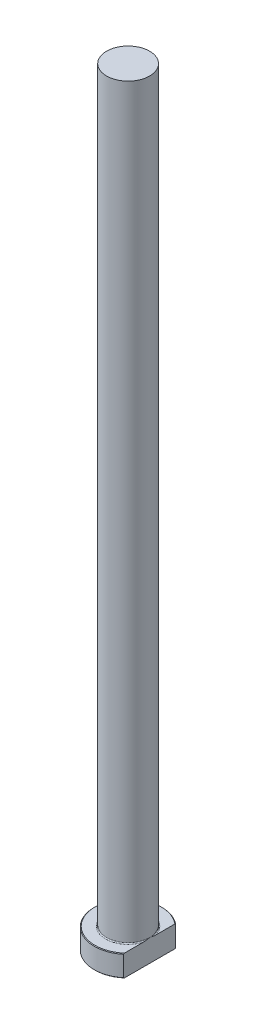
ISO-10303-21;
HEADER;
FILE_DESCRIPTION(('STEP AP214'),'2;1');
FILE_NAME('part.step','',(''),(''),'','','');
FILE_SCHEMA(('AUTOMOTIVE_DESIGN { 1 0 10303 214 1 1 1 1 }'));
ENDSEC;
DATA;
#1=APPLICATION_CONTEXT('core data for automotive mechanical design processes');
#2=APPLICATION_PROTOCOL_DEFINITION('international standard','automotive_design',2000,#1);
#3=PRODUCT_CONTEXT('',#1,'mechanical');
#4=PRODUCT('Part','Part','',(#3));
#5=PRODUCT_RELATED_PRODUCT_CATEGORY('part','',(#4));
#6=PRODUCT_DEFINITION_FORMATION('','',#4);
#7=PRODUCT_DEFINITION_CONTEXT('part definition',#1,'design');
#8=PRODUCT_DEFINITION('design','',#6,#7);
#9=PRODUCT_DEFINITION_SHAPE('','',#8);
#10=(LENGTH_UNIT() NAMED_UNIT(*) SI_UNIT(.MILLI.,.METRE.));
#11=(NAMED_UNIT(*) PLANE_ANGLE_UNIT() SI_UNIT($,.RADIAN.));
#12=(NAMED_UNIT(*) SI_UNIT($,.STERADIAN.) SOLID_ANGLE_UNIT());
#13=UNCERTAINTY_MEASURE_WITH_UNIT(LENGTH_MEASURE(1.E-05),#10,'distance_accuracy_value','');
#14=(GEOMETRIC_REPRESENTATION_CONTEXT(3) GLOBAL_UNCERTAINTY_ASSIGNED_CONTEXT((#13)) GLOBAL_UNIT_ASSIGNED_CONTEXT((#10,
#11,#12)) REPRESENTATION_CONTEXT('',''));
#15=CARTESIAN_POINT('',(0.,0.,0.));
#16=DIRECTION('',(0.,0.,1.));
#17=DIRECTION('',(1.,0.,0.));
#18=AXIS2_PLACEMENT_3D('',#15,#16,#17);
#19=CARTESIAN_POINT('',(0.,0.,0.));
#20=DIRECTION('',(0.,-1.,0.));
#21=DIRECTION('',(0.,0.,-1.));
#22=AXIS2_PLACEMENT_3D('',#19,#20,#21);
#23=PLANE('',#22);
#24=CARTESIAN_POINT('',(0.,0.,0.));
#25=DIRECTION('',(0.,-1.,0.));
#26=DIRECTION('',(0.,0.,-1.));
#27=AXIS2_PLACEMENT_3D('',#24,#25,#26);
#28=CIRCLE('',#27,10.7999999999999);
#29=CARTESIAN_POINT('',(6.99999999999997,0.,8.2243540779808));
#30=VERTEX_POINT('',#29);
#31=CARTESIAN_POINT('',(6.99999999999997,0.,-8.2243540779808));
#32=VERTEX_POINT('',#31);
#33=EDGE_CURVE('E98',#30,#32,#28,.T.);
#34=ORIENTED_EDGE('',*,*,#33,.T.);
#35=DIRECTION('',(0.,0.,1.));
#36=VECTOR('',#35,1.);
#37=CARTESIAN_POINT('',(6.99999999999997,0.,-8.48528137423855));
#38=LINE('',#37,#36);
#39=EDGE_CURVE('E83',#32,#30,#38,.T.);
#40=ORIENTED_EDGE('',*,*,#39,.T.);
#41=EDGE_LOOP('',(#34,#40));
#42=FACE_BOUND('',#41,.T.);
#43=ADVANCED_FACE('F32',(#42),#23,.T.);
#44=CARTESIAN_POINT('',(0.,259.958771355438,0.));
#45=DIRECTION('',(0.,1.,0.));
#46=DIRECTION('',(0.,0.,1.));
#47=AXIS2_PLACEMENT_3D('',#44,#45,#46);
#48=CYLINDRICAL_SURFACE('',#47,11.);
#49=CARTESIAN_POINT('',(0.,6.79999999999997,0.));
#50=DIRECTION('',(0.,1.,0.));
#51=DIRECTION('',(0.,0.,1.));
#52=AXIS2_PLACEMENT_3D('',#49,#50,#51);
#53=CIRCLE('',#52,11.);
#54=CARTESIAN_POINT('',(6.99999999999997,6.79999999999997,8.48528137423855));
#55=VERTEX_POINT('',#54);
#56=CARTESIAN_POINT('',(6.99999999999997,6.79999999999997,-8.48528137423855));
#57=VERTEX_POINT('',#56);
#58=EDGE_CURVE('E104',#55,#57,#53,.F.);
#59=ORIENTED_EDGE('',*,*,#58,.T.);
#60=DIRECTION('',(0.,-1.,0.));
#61=VECTOR('',#60,1.);
#62=CARTESIAN_POINT('',(6.99999999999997,250.,-8.48528137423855));
#63=LINE('',#62,#61);
#64=CARTESIAN_POINT('',(6.99999999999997,0.200000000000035,-8.48528137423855));
#65=VERTEX_POINT('',#64);
#66=EDGE_CURVE('E183',#57,#65,#63,.T.);
#67=ORIENTED_EDGE('',*,*,#66,.T.);
#68=CARTESIAN_POINT('',(0.,0.200000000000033,0.));
#69=DIRECTION('',(0.,-1.,0.));
#70=DIRECTION('',(0.,0.,-1.));
#71=AXIS2_PLACEMENT_3D('',#68,#69,#70);
#72=CIRCLE('',#71,11.);
#73=CARTESIAN_POINT('',(6.99999999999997,0.200000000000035,8.48528137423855));
#74=VERTEX_POINT('',#73);
#75=EDGE_CURVE('E100',#65,#74,#72,.F.);
#76=ORIENTED_EDGE('',*,*,#75,.T.);
#77=DIRECTION('',(0.,-1.,0.));
#78=VECTOR('',#77,1.);
#79=CARTESIAN_POINT('',(6.99999999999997,250.,8.48528137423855));
#80=LINE('',#79,#78);
#81=EDGE_CURVE('E93',#55,#74,#80,.T.);
#82=ORIENTED_EDGE('',*,*,#81,.F.);
#83=EDGE_LOOP('',(#59,#67,#76,#82));
#84=FACE_BOUND('',#83,.T.);
#85=ADVANCED_FACE('F158',(#84),#48,.T.);
#86=CARTESIAN_POINT('',(-11.,7.,0.));
#87=DIRECTION('',(0.,1.,0.));
#88=DIRECTION('',(0.,0.,1.));
#89=AXIS2_PLACEMENT_3D('',#86,#87,#88);
#90=PLANE('',#89);
#91=CARTESIAN_POINT('',(0.,7.,0.));
#92=DIRECTION('',(0.,1.,0.));
#93=DIRECTION('',(0.,0.,1.));
#94=AXIS2_PLACEMENT_3D('',#91,#92,#93);
#95=CIRCLE('',#94,10.8);
#96=CARTESIAN_POINT('',(6.99999999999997,7.,-8.2243540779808));
#97=VERTEX_POINT('',#96);
#98=CARTESIAN_POINT('',(6.99999999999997,7.,8.2243540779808));
#99=VERTEX_POINT('',#98);
#100=EDGE_CURVE('E178',#97,#99,#95,.T.);
#101=ORIENTED_EDGE('',*,*,#100,.T.);
#102=DIRECTION('',(0.,0.,-1.));
#103=VECTOR('',#102,1.);
#104=CARTESIAN_POINT('',(6.99999999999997,7.,0.));
#105=LINE('',#104,#103);
#106=CARTESIAN_POINT('',(6.99999999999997,6.99999999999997,2.07123151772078));
#107=VERTEX_POINT('',#106);
#108=EDGE_CURVE('E57',#99,#107,#105,.T.);
#109=ORIENTED_EDGE('',*,*,#108,.T.);
#110=CARTESIAN_POINT('',(0.,7.,0.));
#111=DIRECTION('',(0.,1.,0.));
#112=DIRECTION('',(0.,0.,1.));
#113=AXIS2_PLACEMENT_3D('',#110,#111,#112);
#114=CIRCLE('',#113,7.29999999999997);
#115=CARTESIAN_POINT('',(6.99999999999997,6.99999999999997,-2.07123151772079));
#116=VERTEX_POINT('',#115);
#117=EDGE_CURVE('E107',#107,#116,#114,.F.);
#118=ORIENTED_EDGE('',*,*,#117,.T.);
#119=EDGE_CURVE('E136',#116,#97,#105,.T.);
#120=ORIENTED_EDGE('',*,*,#119,.T.);
#121=EDGE_LOOP('',(#101,#109,#118,#120));
#122=FACE_BOUND('',#121,.T.);
#123=ADVANCED_FACE('F147',(#122),#90,.T.);
#124=CARTESIAN_POINT('',(0.,7.00000000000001,0.));
#125=DIRECTION('',(0.,-1.,0.));
#126=DIRECTION('',(0.,0.,-1.));
#127=AXIS2_PLACEMENT_3D('',#124,#125,#126);
#128=CONICAL_SURFACE('',#127,10.7999999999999,0.785398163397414);
#129=ORIENTED_EDGE('',*,*,#58,.F.);
#130=CARTESIAN_POINT('',(6.99999999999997,-2.13774979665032,18.6685261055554));
#131=CARTESIAN_POINT('',(6.99999999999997,-1.8657487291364,18.3780244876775));
#132=CARTESIAN_POINT('',(6.99999999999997,-1.59415659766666,18.0871392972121));
#133=CARTESIAN_POINT('',(6.99999999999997,-1.05192877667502,17.5044755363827));
#134=CARTESIAN_POINT('',(6.99999999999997,-0.781293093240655,17.2126969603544));
#135=CARTESIAN_POINT('',(6.99999999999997,-0.241050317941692,16.628048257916));
#136=CARTESIAN_POINT('',(6.99999999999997,0.0285564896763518,16.3351778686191));
#137=CARTESIAN_POINT('',(6.99999999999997,0.566485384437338,15.7482616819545));
#138=CARTESIAN_POINT('',(6.99999999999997,0.834807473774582,15.4542158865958));
#139=CARTESIAN_POINT('',(6.99999999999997,1.64198377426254,14.5651645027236));
#140=CARTESIAN_POINT('',(6.99999999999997,2.17856420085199,13.9680841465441));
#141=CARTESIAN_POINT('',(6.99999999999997,2.97696333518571,13.06681441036));
#142=CARTESIAN_POINT('',(6.99999999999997,3.24199785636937,12.7654727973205));
#143=CARTESIAN_POINT('',(6.99999999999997,3.76945856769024,12.1605141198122));
#144=CARTESIAN_POINT('',(6.99999999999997,4.03188476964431,11.8568970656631));
#145=CARTESIAN_POINT('',(6.99999999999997,4.50733797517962,11.3009625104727));
#146=CARTESIAN_POINT('',(6.99999999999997,4.7208802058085,11.0490858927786));
#147=CARTESIAN_POINT('',(6.99999999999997,5.14538078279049,10.5431655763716));
#148=CARTESIAN_POINT('',(6.99999999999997,5.35633915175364,10.2891218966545));
#149=CARTESIAN_POINT('',(6.99999999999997,5.77522964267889,9.7783673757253));
#150=CARTESIAN_POINT('',(6.99999999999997,5.98316044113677,9.52165544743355));
#151=CARTESIAN_POINT('',(6.99999999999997,6.39521098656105,9.00519084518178));
#152=CARTESIAN_POINT('',(6.99999999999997,6.59933078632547,8.74543821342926));
#153=CARTESIAN_POINT('',(6.99999999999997,7.00243445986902,8.22283607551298));
#154=CARTESIAN_POINT('',(6.99999999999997,7.20142819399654,7.95999419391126));
#155=CARTESIAN_POINT('',(6.99999999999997,7.59353840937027,7.42991856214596));
#156=CARTESIAN_POINT('',(6.99999999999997,7.78665447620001,7.16268450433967));
#157=CARTESIAN_POINT('',(6.99999999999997,8.16523718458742,6.62311113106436));
#158=CARTESIAN_POINT('',(6.99999999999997,8.35070911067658,6.35077553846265));
#159=CARTESIAN_POINT('',(6.99999999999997,8.71189725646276,5.7997373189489));
#160=CARTESIAN_POINT('',(6.99999999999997,8.88761537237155,5.5210359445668));
#161=CARTESIAN_POINT('',(6.99999999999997,9.19554959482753,5.00707921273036));
#162=CARTESIAN_POINT('',(6.99999999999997,9.3298807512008,4.77309669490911));
#163=CARTESIAN_POINT('',(6.99999999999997,9.58764253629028,4.29911523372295));
#164=CARTESIAN_POINT('',(6.99999999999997,9.71107181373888,4.05911554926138));
#165=CARTESIAN_POINT('',(6.99999999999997,9.94390907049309,3.57263619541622));
#166=CARTESIAN_POINT('',(6.99999999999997,10.0533307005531,3.3261631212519));
#167=CARTESIAN_POINT('',(6.99999999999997,10.2545146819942,2.82607166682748));
#168=CARTESIAN_POINT('',(6.99999999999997,10.3462820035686,2.57245532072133));
#169=CARTESIAN_POINT('',(6.99999999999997,10.4907049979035,2.11254447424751));
#170=CARTESIAN_POINT('',(6.99999999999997,10.5475277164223,1.90756611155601));
#171=CARTESIAN_POINT('',(6.99999999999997,10.6452043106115,1.49381161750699));
#172=CARTESIAN_POINT('',(6.99999999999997,10.68606033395,1.2850360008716));
#173=CARTESIAN_POINT('',(6.99999999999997,10.749755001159,0.865342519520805));
#174=CARTESIAN_POINT('',(6.99999999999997,10.772646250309,0.654432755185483));
#175=CARTESIAN_POINT('',(6.99999999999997,10.7993569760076,0.231396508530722));
#176=CARTESIAN_POINT('',(6.99999999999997,10.8031771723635,0.0192700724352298));
#177=CARTESIAN_POINT('',(6.99999999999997,10.7915178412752,-0.404715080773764));
#178=CARTESIAN_POINT('',(6.99999999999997,10.7760135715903,-0.616573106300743));
#179=CARTESIAN_POINT('',(6.99999999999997,10.7265413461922,-1.03810446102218));
#180=CARTESIAN_POINT('',(6.99999999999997,10.6925718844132,-1.24777761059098));
#181=CARTESIAN_POINT('',(6.99999999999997,10.6077703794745,-1.66430273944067));
#182=CARTESIAN_POINT('',(6.99999999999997,10.5568873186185,-1.87114418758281));
#183=CARTESIAN_POINT('',(6.99999999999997,10.4404729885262,-2.28061279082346));
#184=CARTESIAN_POINT('',(6.99999999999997,10.3749414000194,-2.48323985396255));
#185=CARTESIAN_POINT('',(6.99999999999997,10.2190980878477,-2.91860265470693));
#186=CARTESIAN_POINT('',(6.99999999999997,10.1264616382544,-3.15050038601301));
#187=CARTESIAN_POINT('',(6.99999999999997,9.92740958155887,-3.60835455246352));
#188=CARTESIAN_POINT('',(6.99999999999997,9.8209876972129,-3.83430822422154));
#189=CARTESIAN_POINT('',(6.99999999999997,9.59695142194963,-4.28105341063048));
#190=CARTESIAN_POINT('',(6.99999999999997,9.47931762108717,-4.50183511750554));
#191=CARTESIAN_POINT('',(6.99999999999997,9.23524231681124,-4.93840249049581));
#192=CARTESIAN_POINT('',(6.99999999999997,9.10880204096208,-5.1541888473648));
#193=CARTESIAN_POINT('',(6.99999999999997,8.84714657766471,-5.58417945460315));
#194=CARTESIAN_POINT('',(6.99999999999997,8.71183920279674,-5.79832734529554));
#195=CARTESIAN_POINT('',(6.99999999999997,8.43533082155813,-6.22277635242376));
#196=CARTESIAN_POINT('',(6.99999999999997,8.29412966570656,-6.43307737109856));
#197=CARTESIAN_POINT('',(6.99999999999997,8.00706556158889,-6.85014007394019));
#198=CARTESIAN_POINT('',(6.99999999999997,7.86120763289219,-7.05690522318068));
#199=CARTESIAN_POINT('',(6.99999999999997,7.56553131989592,-7.46757278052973));
#200=CARTESIAN_POINT('',(6.99999999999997,7.41571298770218,-7.67147522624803));
#201=CARTESIAN_POINT('',(6.99999999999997,7.0799970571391,-8.12067189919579));
#202=CARTESIAN_POINT('',(6.99999999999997,6.89330819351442,-8.36537403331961));
#203=CARTESIAN_POINT('',(6.99999999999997,6.51597189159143,-8.85171196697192));
#204=CARTESIAN_POINT('',(6.99999999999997,6.32532432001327,-9.09334766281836));
#205=CARTESIAN_POINT('',(6.99999999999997,5.94076020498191,-9.57404667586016));
#206=CARTESIAN_POINT('',(6.99999999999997,5.74684327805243,-9.81310968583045));
#207=CARTESIAN_POINT('',(6.99999999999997,5.35630729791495,-10.2890203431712));
#208=CARTESIAN_POINT('',(6.99999999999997,5.15968820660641,-10.5258679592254));
#209=CARTESIAN_POINT('',(6.99999999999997,4.5660695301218,-11.2340330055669));
#210=CARTESIAN_POINT('',(6.99999999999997,4.16568148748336,-11.7025100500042));
#211=CARTESIAN_POINT('',(6.99999999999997,3.3584003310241,-12.6338245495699));
#212=CARTESIAN_POINT('',(6.99999999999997,2.95150704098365,-13.0966618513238));
#213=CARTESIAN_POINT('',(6.99999999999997,2.35017562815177,-13.7734103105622));
#214=CARTESIAN_POINT('',(6.99999999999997,2.15763812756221,-13.9890143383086));
#215=CARTESIAN_POINT('',(6.99999999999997,1.77161609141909,-14.4193671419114));
#216=CARTESIAN_POINT('',(6.99999999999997,1.57813157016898,-14.6341159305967));
#217=CARTESIAN_POINT('',(6.99999999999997,0.99641244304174,-15.277238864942));
#218=CARTESIAN_POINT('',(6.99999999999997,0.60692265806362,-15.704477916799));
#219=CARTESIAN_POINT('',(6.99999999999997,-0.173895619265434,-16.5556520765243));
#220=CARTESIAN_POINT('',(6.99999999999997,-0.565218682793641,-16.9795921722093));
#221=CARTESIAN_POINT('',(6.99999999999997,-1.34999931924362,-17.8254589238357));
#222=CARTESIAN_POINT('',(6.99999999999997,-1.74345679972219,-18.2473856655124));
#223=CARTESIAN_POINT('',(6.99999999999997,-2.13774979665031,-18.6685261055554));
#224=B_SPLINE_CURVE_WITH_KNOTS('',3,(#130,#131,#132,#133,#134,#135,#136,#137,#138,#139,#140,
#141,#142,#143,#144,#145,#146,#147,#148,#149,#150,#151,#152,#153,#154,#155,#156,#157,#158,#159,
#160,#161,#162,#163,#164,#165,#166,#167,#168,#169,#170,#171,#172,#173,#174,#175,#176,#177,#178,
#179,#180,#181,#182,#183,#184,#185,#186,#187,#188,#189,#190,#191,#192,#193,#194,#195,#196,#197,
#198,#199,#200,#201,#202,#203,#204,#205,#206,#207,#208,#209,#210,#211,#212,#213,#214,#215,#216,
#217,#218,#219,#220,#221,#222,#223),.UNSPECIFIED.,.F.,.F.,(4,2,2,2,2,2,2,2,2,2,2,2,2,2,2,2,2,2,
2,2,2,2,2,2,2,2,2,2,2,2,2,2,2,2,2,2,2,2,2,2,2,2,2,2,2,2,4),(0.,1.19389386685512,
2.38779531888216,3.58200567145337,4.77621398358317,7.18442154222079,8.38834194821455,
9.5922568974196,10.5828886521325,11.5735117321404,12.5645555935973,13.5555857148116,
14.5445404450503,15.5335647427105,16.5218934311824,17.5100293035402,18.3192088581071,
19.1284885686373,19.93697351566,20.7452305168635,21.3828127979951,22.0203092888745,
22.6559319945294,23.2915307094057,23.9279440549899,24.5644093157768,25.2028120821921,
25.8412287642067,26.589809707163,27.3387327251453,28.0889766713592,28.8391162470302,
29.5989369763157,30.3587769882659,31.1178239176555,31.876860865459,32.800165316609,
33.7235009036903,34.6469455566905,35.5704032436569,37.4191008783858,39.267848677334,
40.1350269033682,41.0021920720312,42.7365692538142,44.4673795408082,46.1981154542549),.UNSPECIFIED.);
#225=EDGE_CURVE('E135',#55,#99,#224,.T.);
#226=ORIENTED_EDGE('',*,*,#225,.T.);
#227=ORIENTED_EDGE('',*,*,#100,.F.);
#228=EDGE_CURVE('E127',#97,#57,#224,.T.);
#229=ORIENTED_EDGE('',*,*,#228,.T.);
#230=EDGE_LOOP('',(#129,#226,#227,#229));
#231=FACE_BOUND('',#230,.T.);
#232=ADVANCED_FACE('F143',(#231),#128,.T.);
#233=CARTESIAN_POINT('',(0.,0.200000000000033,0.));
#234=DIRECTION('',(0.,1.,0.));
#235=DIRECTION('',(0.,0.,1.));
#236=AXIS2_PLACEMENT_3D('',#233,#234,#235);
#237=CONICAL_SURFACE('',#236,11.,0.785398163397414);
#238=ORIENTED_EDGE('',*,*,#75,.F.);
#239=CARTESIAN_POINT('',(6.99999999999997,9.13774979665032,-18.6685261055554));
#240=CARTESIAN_POINT('',(6.99999999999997,8.86574872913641,-18.3780244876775));
#241=CARTESIAN_POINT('',(6.99999999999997,8.59415659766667,-18.0871392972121));
#242=CARTESIAN_POINT('',(6.99999999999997,8.05192877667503,-17.5044755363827));
#243=CARTESIAN_POINT('',(6.99999999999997,7.78129309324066,-17.2126969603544));
#244=CARTESIAN_POINT('',(6.99999999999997,7.2410503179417,-16.628048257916));
#245=CARTESIAN_POINT('',(6.99999999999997,6.97144351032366,-16.3351778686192));
#246=CARTESIAN_POINT('',(6.99999999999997,6.43351461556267,-15.7482616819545));
#247=CARTESIAN_POINT('',(6.99999999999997,6.16519252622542,-15.4542158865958));
#248=CARTESIAN_POINT('',(6.99999999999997,5.35801622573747,-14.5651645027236));
#249=CARTESIAN_POINT('',(6.99999999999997,4.82143579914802,-13.9680841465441));
#250=CARTESIAN_POINT('',(6.99999999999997,4.0230366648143,-13.06681441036));
#251=CARTESIAN_POINT('',(6.99999999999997,3.75800214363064,-12.7654727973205));
#252=CARTESIAN_POINT('',(6.99999999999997,3.23054143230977,-12.1605141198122));
#253=CARTESIAN_POINT('',(6.99999999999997,2.96811523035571,-11.8568970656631));
#254=CARTESIAN_POINT('',(6.99999999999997,2.49266202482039,-11.3009625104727));
#255=CARTESIAN_POINT('',(6.99999999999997,2.27911979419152,-11.0490858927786));
#256=CARTESIAN_POINT('',(6.99999999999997,1.85461921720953,-10.5431655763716));
#257=CARTESIAN_POINT('',(6.99999999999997,1.64366084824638,-10.2891218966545));
#258=CARTESIAN_POINT('',(6.99999999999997,1.22477035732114,-9.77836737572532));
#259=CARTESIAN_POINT('',(6.99999999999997,1.01683955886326,-9.52165544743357));
#260=CARTESIAN_POINT('',(6.99999999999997,0.60478901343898,-9.00519084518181));
#261=CARTESIAN_POINT('',(6.99999999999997,0.400669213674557,-8.74543821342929));
#262=CARTESIAN_POINT('',(6.99999999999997,-0.00243445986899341,-8.22283607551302));
#263=CARTESIAN_POINT('',(6.99999999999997,-0.201428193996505,-7.9599941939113));
#264=CARTESIAN_POINT('',(6.99999999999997,-0.593538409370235,-7.429918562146));
#265=CARTESIAN_POINT('',(6.99999999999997,-0.786654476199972,-7.16268450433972));
#266=CARTESIAN_POINT('',(6.99999999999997,-1.16523718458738,-6.62311113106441));
#267=CARTESIAN_POINT('',(6.99999999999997,-1.35070911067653,-6.35077553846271));
#268=CARTESIAN_POINT('',(6.99999999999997,-1.71189725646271,-5.79973731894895));
#269=CARTESIAN_POINT('',(6.99999999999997,-1.8876153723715,-5.52103594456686));
#270=CARTESIAN_POINT('',(6.99999999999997,-2.19554959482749,-5.00707921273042));
#271=CARTESIAN_POINT('',(6.99999999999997,-2.32988075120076,-4.77309669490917));
#272=CARTESIAN_POINT('',(6.99999999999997,-2.58764253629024,-4.29911523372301));
#273=CARTESIAN_POINT('',(6.99999999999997,-2.71107181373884,-4.05911554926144));
#274=CARTESIAN_POINT('',(6.99999999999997,-2.94390907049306,-3.57263619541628));
#275=CARTESIAN_POINT('',(6.99999999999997,-3.05333070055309,-3.32616312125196));
#276=CARTESIAN_POINT('',(6.99999999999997,-3.25451468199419,-2.82607166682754));
#277=CARTESIAN_POINT('',(6.99999999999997,-3.34628200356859,-2.57245532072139));
#278=CARTESIAN_POINT('',(6.99999999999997,-3.49070499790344,-2.11254447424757));
#279=CARTESIAN_POINT('',(6.99999999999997,-3.54752771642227,-1.90756611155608));
#280=CARTESIAN_POINT('',(6.99999999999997,-3.6452043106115,-1.49381161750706));
#281=CARTESIAN_POINT('',(6.99999999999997,-3.68606033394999,-1.28503600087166));
#282=CARTESIAN_POINT('',(6.99999999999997,-3.74975500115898,-0.865342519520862));
#283=CARTESIAN_POINT('',(6.99999999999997,-3.77264625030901,-0.65443275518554));
#284=CARTESIAN_POINT('',(6.99999999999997,-3.79935697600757,-0.231396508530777));
#285=CARTESIAN_POINT('',(6.99999999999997,-3.80317717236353,-0.0192700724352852));
#286=CARTESIAN_POINT('',(6.99999999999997,-3.79151784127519,0.404715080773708));
#287=CARTESIAN_POINT('',(6.99999999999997,-3.77601357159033,0.616573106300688));
#288=CARTESIAN_POINT('',(6.99999999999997,-3.7265413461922,1.03810446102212));
#289=CARTESIAN_POINT('',(6.99999999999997,-3.69257188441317,1.24777761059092));
#290=CARTESIAN_POINT('',(6.99999999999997,-3.60777037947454,1.66430273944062));
#291=CARTESIAN_POINT('',(6.99999999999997,-3.55688731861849,1.87114418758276));
#292=CARTESIAN_POINT('',(6.99999999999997,-3.44047298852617,2.28061279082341));
#293=CARTESIAN_POINT('',(6.99999999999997,-3.37494140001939,2.48323985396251));
#294=CARTESIAN_POINT('',(6.99999999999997,-3.21909808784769,2.91860265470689));
#295=CARTESIAN_POINT('',(6.99999999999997,-3.12646163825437,3.15050038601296));
#296=CARTESIAN_POINT('',(6.99999999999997,-2.92740958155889,3.60835455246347));
#297=CARTESIAN_POINT('',(6.99999999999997,-2.82098769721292,3.83430822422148));
#298=CARTESIAN_POINT('',(6.99999999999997,-2.59695142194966,4.28105341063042));
#299=CARTESIAN_POINT('',(6.99999999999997,-2.4793176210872,4.50183511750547));
#300=CARTESIAN_POINT('',(6.99999999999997,-2.23524231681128,4.93840249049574));
#301=CARTESIAN_POINT('',(6.99999999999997,-2.10880204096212,5.15418884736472));
#302=CARTESIAN_POINT('',(6.99999999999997,-1.84714657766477,5.58417945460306));
#303=CARTESIAN_POINT('',(6.99999999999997,-1.7118392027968,5.79832734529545));
#304=CARTESIAN_POINT('',(6.99999999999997,-1.43533082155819,6.22277635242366));
#305=CARTESIAN_POINT('',(6.99999999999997,-1.29412966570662,6.43307737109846));
#306=CARTESIAN_POINT('',(6.99999999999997,-1.00706556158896,6.85014007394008));
#307=CARTESIAN_POINT('',(6.99999999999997,-0.86120763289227,7.05690522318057));
#308=CARTESIAN_POINT('',(6.99999999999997,-0.565531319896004,7.46757278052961));
#309=CARTESIAN_POINT('',(6.99999999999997,-0.415712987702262,7.6714752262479));
#310=CARTESIAN_POINT('',(6.99999999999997,-0.0799970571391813,8.12067189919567));
#311=CARTESIAN_POINT('',(6.99999999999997,0.1066918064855,8.36537403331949));
#312=CARTESIAN_POINT('',(6.99999999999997,0.484028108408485,8.85171196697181));
#313=CARTESIAN_POINT('',(6.99999999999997,0.674675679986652,9.09334766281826));
#314=CARTESIAN_POINT('',(6.99999999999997,1.05923979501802,9.57404667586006));
#315=CARTESIAN_POINT('',(6.99999999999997,1.2531567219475,9.81310968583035));
#316=CARTESIAN_POINT('',(6.99999999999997,1.64369270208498,10.2890203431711));
#317=CARTESIAN_POINT('',(6.99999999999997,1.84031179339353,10.5258679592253));
#318=CARTESIAN_POINT('',(6.99999999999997,2.43393046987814,11.2340330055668));
#319=CARTESIAN_POINT('',(6.99999999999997,2.83431851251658,11.7025100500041));
#320=CARTESIAN_POINT('',(6.99999999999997,3.64159966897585,12.6338245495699));
#321=CARTESIAN_POINT('',(6.99999999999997,4.04849295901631,13.0966618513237));
#322=CARTESIAN_POINT('',(6.99999999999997,4.64982437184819,13.7734103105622));
#323=CARTESIAN_POINT('',(6.99999999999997,4.84236187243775,13.9890143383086));
#324=CARTESIAN_POINT('',(6.99999999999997,5.22838390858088,14.4193671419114));
#325=CARTESIAN_POINT('',(6.99999999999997,5.42186842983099,14.6341159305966));
#326=CARTESIAN_POINT('',(6.99999999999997,6.00358755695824,15.2772388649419));
#327=CARTESIAN_POINT('',(6.99999999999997,6.39307734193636,15.704477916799));
#328=CARTESIAN_POINT('',(6.99999999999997,7.17389561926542,16.5556520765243));
#329=CARTESIAN_POINT('',(6.99999999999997,7.56521868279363,16.9795921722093));
#330=CARTESIAN_POINT('',(6.99999999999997,8.34999931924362,17.8254589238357));
#331=CARTESIAN_POINT('',(6.99999999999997,8.74345679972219,18.2473856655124));
#332=CARTESIAN_POINT('',(6.99999999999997,9.13774979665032,18.6685261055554));
#333=B_SPLINE_CURVE_WITH_KNOTS('',3,(#239,#240,#241,#242,#243,#244,#245,#246,#247,#248,#249,
#250,#251,#252,#253,#254,#255,#256,#257,#258,#259,#260,#261,#262,#263,#264,#265,#266,#267,#268,
#269,#270,#271,#272,#273,#274,#275,#276,#277,#278,#279,#280,#281,#282,#283,#284,#285,#286,#287,
#288,#289,#290,#291,#292,#293,#294,#295,#296,#297,#298,#299,#300,#301,#302,#303,#304,#305,#306,
#307,#308,#309,#310,#311,#312,#313,#314,#315,#316,#317,#318,#319,#320,#321,#322,#323,#324,#325,
#326,#327,#328,#329,#330,#331,#332),.UNSPECIFIED.,.F.,.F.,(4,2,2,2,2,2,2,2,2,2,2,2,2,2,2,2,2,2,
2,2,2,2,2,2,2,2,2,2,2,2,2,2,2,2,2,2,2,2,2,2,2,2,2,2,2,2,4),(0.,1.19389386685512,
2.38779531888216,3.58200567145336,4.77621398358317,7.18442154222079,8.38834194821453,
9.59225689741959,10.5828886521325,11.5735117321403,12.5645555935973,13.5555857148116,
14.5445404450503,15.5335647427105,16.5218934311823,17.5100293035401,18.319208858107,
19.1284885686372,19.93697351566,20.7452305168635,21.382812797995,22.0203092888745,
22.6559319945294,23.2915307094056,23.9279440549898,24.5644093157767,25.2028120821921,
25.8412287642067,26.589809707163,27.3387327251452,28.0889766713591,28.8391162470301,
29.5989369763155,30.3587769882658,31.1178239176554,31.8768608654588,32.8001653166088,
33.7235009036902,34.6469455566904,35.5704032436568,37.4191008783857,39.2678486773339,
40.1350269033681,41.0021920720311,42.7365692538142,44.4673795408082,46.1981154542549),.UNSPECIFIED.);
#334=EDGE_CURVE('E86',#65,#32,#333,.T.);
#335=ORIENTED_EDGE('',*,*,#334,.T.);
#336=ORIENTED_EDGE('',*,*,#33,.F.);
#337=EDGE_CURVE('E89',#30,#74,#333,.T.);
#338=ORIENTED_EDGE('',*,*,#337,.T.);
#339=EDGE_LOOP('',(#238,#335,#336,#338));
#340=FACE_BOUND('',#339,.T.);
#341=ADVANCED_FACE('F97',(#340),#237,.T.);
#342=CARTESIAN_POINT('',(0.,7.29999999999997,0.));
#343=DIRECTION('',(0.,1.,0.));
#344=DIRECTION('',(0.,0.,1.));
#345=AXIS2_PLACEMENT_3D('',#342,#343,#344);
#346=TOROIDAL_SURFACE('',#345,7.29999999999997,0.3);
#347=CARTESIAN_POINT('',(6.99999999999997,7.29999999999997,0.));
#348=CARTESIAN_POINT('',(6.99999999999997,7.30000062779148,2.32628005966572E-11));
#349=CARTESIAN_POINT('',(6.99999999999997,7.30000125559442,-3.16909134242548E-07));
#350=CARTESIAN_POINT('',(6.99999999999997,7.30000241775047,-1.14637029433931E-06));
#351=CARTESIAN_POINT('',(6.99999999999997,7.30000292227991,-1.68168827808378E-06));
#352=CARTESIAN_POINT('',(6.99999999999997,7.30000400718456,-2.97869768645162E-06));
#353=CARTESIAN_POINT('',(6.99999999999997,7.30000456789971,-3.76131367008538E-06));
#354=CARTESIAN_POINT('',(6.99999999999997,7.30000553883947,-5.35167977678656E-06));
#355=CARTESIAN_POINT('',(6.99999999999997,7.30000595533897,-6.15604635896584E-06));
#356=CARTESIAN_POINT('',(6.99999999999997,7.30000758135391,-9.388029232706E-06));
#357=CARTESIAN_POINT('',(6.99999999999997,7.30000871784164,-1.18573464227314E-05));
#358=CARTESIAN_POINT('',(6.99999999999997,7.30001050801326,-1.66549715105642E-05));
#359=CARTESIAN_POINT('',(6.99999999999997,7.30001120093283,-1.89691200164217E-05));
#360=CARTESIAN_POINT('',(6.99999999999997,7.30001423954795,-2.9073526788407E-05));
#361=CARTESIAN_POINT('',(6.99999999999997,7.30001661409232,-3.68567169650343E-05));
#362=CARTESIAN_POINT('',(6.99999999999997,7.30001997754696,-5.13387672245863E-05));
#363=CARTESIAN_POINT('',(6.99999999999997,7.30002113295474,-5.79981986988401E-05));
#364=CARTESIAN_POINT('',(6.99999999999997,7.30002974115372,-0.000108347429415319));
#365=CARTESIAN_POINT('',(6.99999999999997,7.30003649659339,-0.000152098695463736));
#366=CARTESIAN_POINT('',(6.99999999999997,7.30006604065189,-0.000326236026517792));
#367=CARTESIAN_POINT('',(6.99999999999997,7.30009398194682,-0.000455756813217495));
#368=CARTESIAN_POINT('',(6.99999999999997,7.30020370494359,-0.000971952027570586));
#369=CARTESIAN_POINT('',(6.99999999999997,7.30028233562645,-0.00135905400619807));
#370=CARTESIAN_POINT('',(6.99999999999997,7.30059908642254,-0.00290811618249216));
#371=CARTESIAN_POINT('',(6.99999999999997,7.30084128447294,-0.00406949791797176));
#372=CARTESIAN_POINT('',(6.99999999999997,7.30185637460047,-0.00894870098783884));
#373=CARTESIAN_POINT('',(6.99999999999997,7.30262406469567,-0.0126672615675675));
#374=CARTESIAN_POINT('',(6.99999999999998,7.30904362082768,-0.0437472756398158));
#375=CARTESIAN_POINT('',(6.99999999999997,7.31471492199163,-0.0711060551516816));
#376=CARTESIAN_POINT('',(6.99999999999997,7.3257989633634,-0.124711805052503));
#377=CARTESIAN_POINT('',(6.99999999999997,7.33121280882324,-0.150958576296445));
#378=CARTESIAN_POINT('',(6.99999999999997,7.34888721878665,-0.236855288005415));
#379=CARTESIAN_POINT('',(6.99999999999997,7.36109504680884,-0.296516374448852));
#380=CARTESIAN_POINT('',(6.99999999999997,7.38163193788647,-0.398125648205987));
#381=CARTESIAN_POINT('',(6.99999999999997,7.39003371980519,-0.440059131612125));
#382=CARTESIAN_POINT('',(6.99999999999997,7.40641913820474,-0.522820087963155));
#383=CARTESIAN_POINT('',(6.99999999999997,7.41440792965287,-0.563646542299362));
#384=CARTESIAN_POINT('',(6.99999999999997,7.44025584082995,-0.697745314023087));
#385=CARTESIAN_POINT('',(6.99999999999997,7.45763052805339,-0.791112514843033));
#386=CARTESIAN_POINT('',(6.99999999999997,7.4907040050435,-0.979068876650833));
#387=CARTESIAN_POINT('',(6.99999999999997,7.50638514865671,-1.07366117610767));
#388=CARTESIAN_POINT('',(6.99999999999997,7.53649600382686,-1.27237182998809));
#389=CARTESIAN_POINT('',(6.99999999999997,7.55066037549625,-1.37653153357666));
#390=CARTESIAN_POINT('',(6.99999999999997,7.57450660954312,-1.58508707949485));
#391=CARTESIAN_POINT('',(6.99999999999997,7.58420070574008,-1.68948148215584));
#392=CARTESIAN_POINT('',(6.99999999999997,7.5971656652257,-1.89515538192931));
#393=CARTESIAN_POINT('',(6.99999999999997,7.60064432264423,-1.9964196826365));
#394=CARTESIAN_POINT('',(6.99999999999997,7.59954163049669,-2.14745317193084));
#395=CARTESIAN_POINT('',(6.99999999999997,7.59815772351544,-2.19724153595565));
#396=CARTESIAN_POINT('',(6.99999999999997,7.59283451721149,-2.29666246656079));
#397=CARTESIAN_POINT('',(6.99999999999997,7.58889656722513,-2.34629510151));
#398=CARTESIAN_POINT('',(6.99999999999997,7.57769755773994,-2.44571674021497));
#399=CARTESIAN_POINT('',(6.99999999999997,7.57040396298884,-2.49550242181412));
#400=CARTESIAN_POINT('',(6.99999999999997,7.5560244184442,-2.56951537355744));
#401=CARTESIAN_POINT('',(6.99999999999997,7.55065780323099,-2.59407625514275));
#402=CARTESIAN_POINT('',(6.99999999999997,7.53852479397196,-2.642845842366));
#403=CARTESIAN_POINT('',(6.99999999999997,7.53175908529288,-2.66705471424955));
#404=CARTESIAN_POINT('',(6.99999999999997,7.5174892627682,-2.71174649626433));
#405=CARTESIAN_POINT('',(6.99999999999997,7.510201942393,-2.73229789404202));
#406=CARTESIAN_POINT('',(6.99999999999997,7.4939308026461,-2.77282387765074));
#407=CARTESIAN_POINT('',(6.99999999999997,7.4849410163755,-2.79279614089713));
#408=CARTESIAN_POINT('',(6.99999999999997,7.46462265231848,-2.83190553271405));
#409=CARTESIAN_POINT('',(6.99999999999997,7.45326134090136,-2.85102586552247));
#410=CARTESIAN_POINT('',(6.99999999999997,7.4274542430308,-2.88704231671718));
#411=CARTESIAN_POINT('',(6.99999999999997,7.41303489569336,-2.90395561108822));
#412=CARTESIAN_POINT('',(6.99999999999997,7.39049681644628,-2.92384155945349));
#413=CARTESIAN_POINT('',(6.99999999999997,7.3841904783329,-2.92884725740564));
#414=CARTESIAN_POINT('',(6.99999999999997,7.3709718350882,-2.9380049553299));
#415=CARTESIAN_POINT('',(6.99999999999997,7.36405938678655,-2.94215675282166));
#416=CARTESIAN_POINT('',(6.99999999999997,7.34956926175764,-2.94936604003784));
#417=CARTESIAN_POINT('',(6.99999999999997,7.34198467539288,-2.95240998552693));
#418=CARTESIAN_POINT('',(6.99999999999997,7.32637763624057,-2.95700924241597));
#419=CARTESIAN_POINT('',(6.99999999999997,7.31835605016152,-2.95856739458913));
#420=CARTESIAN_POINT('',(6.99999999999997,7.3029104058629,-2.95992508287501));
#421=CARTESIAN_POINT('',(6.99999999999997,7.29549953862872,-2.95987367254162));
#422=CARTESIAN_POINT('',(6.99999999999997,7.28081803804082,-2.95838504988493));
#423=CARTESIAN_POINT('',(6.99999999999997,7.27354749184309,-2.95694700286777));
#424=CARTESIAN_POINT('',(6.99999999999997,7.25853285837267,-2.95260391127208));
#425=CARTESIAN_POINT('',(6.99999999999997,7.25083383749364,-2.94954604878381));
#426=CARTESIAN_POINT('',(6.99999999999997,7.23603628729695,-2.9422241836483));
#427=CARTESIAN_POINT('',(6.99999999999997,7.22893877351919,-2.93795819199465));
#428=CARTESIAN_POINT('',(6.99999999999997,7.21163875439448,-2.92593351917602));
#429=CARTESIAN_POINT('',(6.99999999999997,7.20187862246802,-2.91754511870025));
#430=CARTESIAN_POINT('',(6.99999999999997,7.18370674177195,-2.89942475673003));
#431=CARTESIAN_POINT('',(6.99999999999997,7.17529892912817,-2.88968902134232));
#432=CARTESIAN_POINT('',(6.99999999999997,7.15199560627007,-2.85953893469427));
#433=CARTESIAN_POINT('',(6.99999999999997,7.13869481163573,-2.83790736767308));
#434=CARTESIAN_POINT('',(6.99999999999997,7.11507068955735,-2.79314645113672));
#435=CARTESIAN_POINT('',(6.99999999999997,7.10475206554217,-2.77001480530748));
#436=CARTESIAN_POINT('',(6.99999999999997,7.08155610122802,-2.7108784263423));
#437=CARTESIAN_POINT('',(6.99999999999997,7.07006528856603,-2.67433519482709));
#438=CARTESIAN_POINT('',(6.99999999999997,7.05044959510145,-2.60033159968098));
#439=CARTESIAN_POINT('',(6.99999999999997,7.04233234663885,-2.5628693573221));
#440=CARTESIAN_POINT('',(6.99999999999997,7.02853576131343,-2.48688638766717));
#441=CARTESIAN_POINT('',(6.99999999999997,7.02289758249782,-2.4483583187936));
#442=CARTESIAN_POINT('',(6.99999999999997,7.01369461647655,-2.37112071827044));
#443=CARTESIAN_POINT('',(6.99999999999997,7.01012698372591,-2.33241150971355));
#444=CARTESIAN_POINT('',(6.99999999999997,7.00239886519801,-2.22280038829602));
#445=CARTESIAN_POINT('',(6.99999999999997,7.00019016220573,-2.15176184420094));
#446=CARTESIAN_POINT('',(6.99999999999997,6.99983406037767,-2.0096618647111));
#447=CARTESIAN_POINT('',(6.99999999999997,7.00168936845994,-1.9386004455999));
#448=CARTESIAN_POINT('',(6.99999999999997,7.00854815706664,-1.79630907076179));
#449=CARTESIAN_POINT('',(6.99999999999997,7.01356610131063,-1.7250798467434));
#450=CARTESIAN_POINT('',(6.99999999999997,7.02608998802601,-1.5828366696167));
#451=CARTESIAN_POINT('',(6.99999999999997,7.03359634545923,-1.51182275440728));
#452=CARTESIAN_POINT('',(6.99999999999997,7.0575822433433,-1.31152735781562));
#453=CARTESIAN_POINT('',(6.99999999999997,7.07635481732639,-1.18252326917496));
#454=CARTESIAN_POINT('',(6.99999999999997,7.11790553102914,-0.926646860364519));
#455=CARTESIAN_POINT('',(6.99999999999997,7.14063741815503,-0.799766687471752));
#456=CARTESIAN_POINT('',(6.99999999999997,7.17322033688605,-0.627620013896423));
#457=CARTESIAN_POINT('',(6.99999999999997,7.18199317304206,-0.582145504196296));
#458=CARTESIAN_POINT('',(6.99999999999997,7.20004716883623,-0.489938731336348));
#459=CARTESIAN_POINT('',(6.99999999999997,7.20933569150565,-0.443207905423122));
#460=CARTESIAN_POINT('',(6.99999999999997,7.22546843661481,-0.362914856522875));
#461=CARTESIAN_POINT('',(6.99999999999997,7.23226586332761,-0.329343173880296));
#462=CARTESIAN_POINT('',(6.99999999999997,7.24586025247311,-0.262588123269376));
#463=CARTESIAN_POINT('',(6.99999999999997,7.25265638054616,-0.22940458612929));
#464=CARTESIAN_POINT('',(6.99999999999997,7.26550614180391,-0.166874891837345));
#465=CARTESIAN_POINT('',(6.99999999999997,7.27155497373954,-0.137527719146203));
#466=CARTESIAN_POINT('',(6.99999999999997,7.28394498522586,-0.0775831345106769));
#467=CARTESIAN_POINT('',(6.99999999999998,7.29028759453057,-0.0469859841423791));
#468=CARTESIAN_POINT('',(6.99999999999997,7.29737625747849,-0.0126656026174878));
#469=CARTESIAN_POINT('',(6.99999999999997,7.29814430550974,-0.00894538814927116));
#470=CARTESIAN_POINT('',(6.99999999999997,7.29915947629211,-0.00406582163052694));
#471=CARTESIAN_POINT('',(6.99999999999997,7.29940140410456,-0.00290573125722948));
#472=CARTESIAN_POINT('',(6.99999999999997,7.29971782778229,-0.00135826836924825));
#473=CARTESIAN_POINT('',(6.99999999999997,7.29979639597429,-0.000971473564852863));
#474=CARTESIAN_POINT('',(6.99999999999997,7.29990604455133,-0.000455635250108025));
#475=CARTESIAN_POINT('',(6.99999999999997,7.2999339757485,-0.00032616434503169));
#476=CARTESIAN_POINT('',(6.99999999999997,7.29996351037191,-0.000152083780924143));
#477=CARTESIAN_POINT('',(6.99999999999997,7.29997026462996,-0.000108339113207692));
#478=CARTESIAN_POINT('',(6.99999999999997,7.29997887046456,-5.7996672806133E-05));
#479=CARTESIAN_POINT('',(6.99999999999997,7.29998002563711,-5.13375704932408E-05));
#480=CARTESIAN_POINT('',(6.99999999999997,7.29998338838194,-3.6856228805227E-05));
#481=CARTESIAN_POINT('',(6.99999999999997,7.29998576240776,-2.90734013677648E-05));
#482=CARTESIAN_POINT('',(6.99999999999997,7.29998880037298,-1.8969379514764E-05));
#483=CARTESIAN_POINT('',(6.99999999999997,7.29998949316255,-1.6655255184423E-05));
#484=CARTESIAN_POINT('',(6.99999999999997,7.29999128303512,-1.18576604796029E-05));
#485=CARTESIAN_POINT('',(6.99999999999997,7.29999241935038,-9.38834597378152E-06));
#486=CARTESIAN_POINT('',(6.99999999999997,7.29999404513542,-6.15634598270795E-06));
#487=CARTESIAN_POINT('',(6.99999999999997,7.29999446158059,-5.35196743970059E-06));
#488=CARTESIAN_POINT('',(6.99999999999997,7.29999543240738,-3.76156762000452E-06));
#489=CARTESIAN_POINT('',(6.99999999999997,7.29999599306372,-2.97892931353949E-06));
#490=CARTESIAN_POINT('',(6.99999999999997,7.29999707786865,-1.68186918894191E-06));
#491=CARTESIAN_POINT('',(6.99999999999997,7.29999758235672,-1.14652503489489E-06));
#492=CARTESIAN_POINT('',(6.99999999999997,7.2999987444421,-3.16995271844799E-07));
#493=CARTESIAN_POINT('',(6.99999999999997,7.29999937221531,-2.32625469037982E-11));
#494=CARTESIAN_POINT('',(6.99999999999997,7.29999999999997,0.));
#495=B_SPLINE_CURVE_WITH_KNOTS('',3,(#347,#348,#349,#350,#351,#352,#353,#354,#355,#356,#357,
#358,#359,#360,#361,#362,#363,#364,#365,#366,#367,#368,#369,#370,#371,#372,#373,#374,#375,#376,
#377,#378,#379,#380,#381,#382,#383,#384,#385,#386,#387,#388,#389,#390,#391,#392,#393,#394,#395,
#396,#397,#398,#399,#400,#401,#402,#403,#404,#405,#406,#407,#408,#409,#410,#411,#412,#413,#414,
#415,#416,#417,#418,#419,#420,#421,#422,#423,#424,#425,#426,#427,#428,#429,#430,#431,#432,#433,
#434,#435,#436,#437,#438,#439,#440,#441,#442,#443,#444,#445,#446,#447,#448,#449,#450,#451,#452,
#453,#454,#455,#456,#457,#458,#459,#460,#461,#462,#463,#464,#465,#466,#467,#468,#469,#470,#471,
#472,#473,#474,#475,#476,#477,#478,#479,#480,#481,#482,#483,#484,#485,#486,#487,#488,#489,#490,
#491,#492,#493,#494),.UNSPECIFIED.,.T.,.F.,(4,2,2,2,2,2,2,2,2,2,2,2,2,2,2,2,2,2,2,2,2,2,2,2,2,2,
2,2,2,2,2,2,2,2,2,2,2,2,2,2,2,2,2,2,2,2,2,2,2,2,2,2,2,2,2,2,2,2,2,2,2,2,2,2,2,2,2,2,2,2,2,2,2,
4),(0.,1.92694204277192E-06,4.154269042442E-06,7.01948468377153E-06,9.73677790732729E-06,
1.78669784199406E-05,2.510708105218E-05,4.94892168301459E-05,6.97447136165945E-05,
0.000202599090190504,0.000599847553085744,0.00178514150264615,0.00534391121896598,
0.0167352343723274,0.100554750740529,0.180953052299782,0.36364407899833,0.491944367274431,
0.616746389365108,0.901643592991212,1.18926961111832,1.50455392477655,1.81897020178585,
2.12266301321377,2.27203455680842,2.42132724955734,2.57209897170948,2.64748997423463,
2.72284413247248,2.7882086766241,2.85380670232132,2.92037838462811,2.98639639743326,
3.01049823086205,3.03460577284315,3.05899886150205,3.08334521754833,3.10544427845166,
3.12755665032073,3.15227309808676,3.17703047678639,3.21542082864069,3.25392097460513,
3.32967543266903,3.4055487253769,3.52018968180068,3.63508860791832,3.75182904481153,
3.86840866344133,4.08144496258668,4.29462320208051,4.5087835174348,4.72297956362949,
5.11393929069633,5.50060554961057,5.63954426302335,5.78247850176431,5.8852372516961,
5.98685401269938,6.07674665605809,6.17048759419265,6.18188399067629,6.18543880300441,
6.18662315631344,6.18702025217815,6.18715308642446,6.18717334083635,6.18719772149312,
6.18720496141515,6.18721309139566,6.1872158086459,6.18721867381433,6.18722090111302,
6.18722282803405),.UNSPECIFIED.);
#496=CARTESIAN_POINT('',(6.99999999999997,7.29999999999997,0.));
#497=VERTEX_POINT('',#496);
#498=EDGE_CURVE('E11',#116,#497,#495,.T.);
#499=ORIENTED_EDGE('',*,*,#498,.F.);
#500=ORIENTED_EDGE('',*,*,#117,.F.);
#501=CARTESIAN_POINT('',(6.99999999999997,7.29999999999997,0.));
#502=CARTESIAN_POINT('',(6.99999999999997,7.29999937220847,-2.32626743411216E-11));
#503=CARTESIAN_POINT('',(6.99999999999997,7.29999874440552,3.16909134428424E-07));
#504=CARTESIAN_POINT('',(6.99999999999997,7.29999758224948,1.14637029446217E-06));
#505=CARTESIAN_POINT('',(6.99999999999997,7.29999707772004,1.68168827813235E-06));
#506=CARTESIAN_POINT('',(6.99999999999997,7.29999599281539,2.97869768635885E-06));
#507=CARTESIAN_POINT('',(6.99999999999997,7.29999543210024,3.76131366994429E-06));
#508=CARTESIAN_POINT('',(6.99999999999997,7.29999446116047,5.35167977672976E-06));
#509=CARTESIAN_POINT('',(6.99999999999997,7.29999404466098,6.15604635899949E-06));
#510=CARTESIAN_POINT('',(6.99999999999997,7.29999241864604,9.38802923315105E-06));
#511=CARTESIAN_POINT('',(6.99999999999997,7.29999128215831,1.18573464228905E-05));
#512=CARTESIAN_POINT('',(6.99999999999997,7.29998949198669,1.66549715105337E-05));
#513=CARTESIAN_POINT('',(6.99999999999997,7.29998879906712,1.8969120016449E-05));
#514=CARTESIAN_POINT('',(6.99999999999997,7.29998576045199,2.90735267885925E-05));
#515=CARTESIAN_POINT('',(6.99999999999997,7.29998338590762,3.68567169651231E-05));
#516=CARTESIAN_POINT('',(6.99999999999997,7.29998002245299,5.13387672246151E-05));
#517=CARTESIAN_POINT('',(6.99999999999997,7.2999788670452,5.7998198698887E-05));
#518=CARTESIAN_POINT('',(6.99999999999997,7.29997025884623,0.00010834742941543));
#519=CARTESIAN_POINT('',(6.99999999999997,7.29996350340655,0.000152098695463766));
#520=CARTESIAN_POINT('',(6.99999999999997,7.29993395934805,0.000326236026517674));
#521=CARTESIAN_POINT('',(6.99999999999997,7.29990601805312,0.000455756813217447));
#522=CARTESIAN_POINT('',(6.99999999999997,7.29979629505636,0.0009719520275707));
#523=CARTESIAN_POINT('',(6.99999999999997,7.2997176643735,0.00135905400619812));
#524=CARTESIAN_POINT('',(6.99999999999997,7.29940091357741,0.00290811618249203));
#525=CARTESIAN_POINT('',(6.99999999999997,7.29915871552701,0.0040694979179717));
#526=CARTESIAN_POINT('',(6.99999999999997,7.29814362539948,0.00894870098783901));
#527=CARTESIAN_POINT('',(6.99999999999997,7.29737593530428,0.0126672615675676));
#528=CARTESIAN_POINT('',(6.99999999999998,7.29095637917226,0.0437472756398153));
#529=CARTESIAN_POINT('',(6.99999999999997,7.28528507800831,0.0711060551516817));
#530=CARTESIAN_POINT('',(6.99999999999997,7.27420103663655,0.124711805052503));
#531=CARTESIAN_POINT('',(6.99999999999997,7.2687871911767,0.150958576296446));
#532=CARTESIAN_POINT('',(6.99999999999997,7.25111278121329,0.236855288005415));
#533=CARTESIAN_POINT('',(6.99999999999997,7.23890495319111,0.296516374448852));
#534=CARTESIAN_POINT('',(6.99999999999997,7.21836806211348,0.398125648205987));
#535=CARTESIAN_POINT('',(6.99999999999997,7.20996628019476,0.440059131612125));
#536=CARTESIAN_POINT('',(6.99999999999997,7.1935808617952,0.522820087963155));
#537=CARTESIAN_POINT('',(6.99999999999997,7.18559207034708,0.563646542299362));
#538=CARTESIAN_POINT('',(6.99999999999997,7.15974415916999,0.697745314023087));
#539=CARTESIAN_POINT('',(6.99999999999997,7.14236947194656,0.791112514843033));
#540=CARTESIAN_POINT('',(6.99999999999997,7.10929599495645,0.979068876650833));
#541=CARTESIAN_POINT('',(6.99999999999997,7.09361485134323,1.07366117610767));
#542=CARTESIAN_POINT('',(6.99999999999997,7.06350399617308,1.27237182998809));
#543=CARTESIAN_POINT('',(6.99999999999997,7.04933962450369,1.37653153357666));
#544=CARTESIAN_POINT('',(6.99999999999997,7.02549339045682,1.58508707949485));
#545=CARTESIAN_POINT('',(6.99999999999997,7.01579929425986,1.68948148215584));
#546=CARTESIAN_POINT('',(6.99999999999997,7.00283433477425,1.89515538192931));
#547=CARTESIAN_POINT('',(6.99999999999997,6.99935567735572,1.9964196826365));
#548=CARTESIAN_POINT('',(6.99999999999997,7.00045836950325,2.14745317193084));
#549=CARTESIAN_POINT('',(6.99999999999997,7.0018422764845,2.19724153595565));
#550=CARTESIAN_POINT('',(6.99999999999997,7.00716548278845,2.29666246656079));
#551=CARTESIAN_POINT('',(6.99999999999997,7.01110343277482,2.34629510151));
#552=CARTESIAN_POINT('',(6.99999999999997,7.02230244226,2.44571674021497));
#553=CARTESIAN_POINT('',(6.99999999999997,7.02959603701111,2.49550242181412));
#554=CARTESIAN_POINT('',(6.99999999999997,7.04397558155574,2.56951537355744));
#555=CARTESIAN_POINT('',(6.99999999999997,7.04934219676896,2.59407625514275));
#556=CARTESIAN_POINT('',(6.99999999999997,7.06147520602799,2.642845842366));
#557=CARTESIAN_POINT('',(6.99999999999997,7.06824091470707,2.66705471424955));
#558=CARTESIAN_POINT('',(6.99999999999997,7.08251073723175,2.71174649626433));
#559=CARTESIAN_POINT('',(6.99999999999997,7.08979805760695,2.73229789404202));
#560=CARTESIAN_POINT('',(6.99999999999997,7.10606919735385,2.77282387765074));
#561=CARTESIAN_POINT('',(6.99999999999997,7.11505898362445,2.79279614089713));
#562=CARTESIAN_POINT('',(6.99999999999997,7.13537734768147,2.83190553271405));
#563=CARTESIAN_POINT('',(6.99999999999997,7.14673865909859,2.85102586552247));
#564=CARTESIAN_POINT('',(6.99999999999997,7.17254575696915,2.88704231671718));
#565=CARTESIAN_POINT('',(6.99999999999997,7.18696510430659,2.90395561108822));
#566=CARTESIAN_POINT('',(6.99999999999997,7.20950318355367,2.92384155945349));
#567=CARTESIAN_POINT('',(6.99999999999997,7.21580952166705,2.92884725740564));
#568=CARTESIAN_POINT('',(6.99999999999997,7.22902816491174,2.9380049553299));
#569=CARTESIAN_POINT('',(6.99999999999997,7.2359406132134,2.94215675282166));
#570=CARTESIAN_POINT('',(6.99999999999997,7.2504307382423,2.94936604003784));
#571=CARTESIAN_POINT('',(6.99999999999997,7.25801532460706,2.95240998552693));
#572=CARTESIAN_POINT('',(6.99999999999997,7.27362236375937,2.95700924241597));
#573=CARTESIAN_POINT('',(6.99999999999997,7.28164394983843,2.95856739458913));
#574=CARTESIAN_POINT('',(6.99999999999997,7.29708959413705,2.95992508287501));
#575=CARTESIAN_POINT('',(6.99999999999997,7.30450046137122,2.95987367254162));
#576=CARTESIAN_POINT('',(6.99999999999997,7.31918196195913,2.95838504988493));
#577=CARTESIAN_POINT('',(6.99999999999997,7.32645250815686,2.95694700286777));
#578=CARTESIAN_POINT('',(6.99999999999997,7.34146714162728,2.95260391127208));
#579=CARTESIAN_POINT('',(6.99999999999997,7.34916616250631,2.94954604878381));
#580=CARTESIAN_POINT('',(6.99999999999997,7.363963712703,2.9422241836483));
#581=CARTESIAN_POINT('',(6.99999999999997,7.37106122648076,2.93795819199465));
#582=CARTESIAN_POINT('',(6.99999999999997,7.38836124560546,2.92593351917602));
#583=CARTESIAN_POINT('',(6.99999999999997,7.39812137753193,2.91754511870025));
#584=CARTESIAN_POINT('',(6.99999999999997,7.416293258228,2.89942475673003));
#585=CARTESIAN_POINT('',(6.99999999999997,7.42470107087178,2.88968902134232));
#586=CARTESIAN_POINT('',(6.99999999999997,7.44800439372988,2.85953893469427));
#587=CARTESIAN_POINT('',(6.99999999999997,7.46130518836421,2.83790736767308));
#588=CARTESIAN_POINT('',(6.99999999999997,7.4849293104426,2.79314645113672));
#589=CARTESIAN_POINT('',(6.99999999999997,7.49524793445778,2.77001480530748));
#590=CARTESIAN_POINT('',(6.99999999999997,7.51844389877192,2.7108784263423));
#591=CARTESIAN_POINT('',(6.99999999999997,7.52993471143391,2.67433519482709));
#592=CARTESIAN_POINT('',(6.99999999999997,7.5495504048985,2.60033159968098));
#593=CARTESIAN_POINT('',(6.99999999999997,7.55766765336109,2.5628693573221));
#594=CARTESIAN_POINT('',(6.99999999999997,7.57146423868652,2.48688638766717));
#595=CARTESIAN_POINT('',(6.99999999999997,7.57710241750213,2.4483583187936));
#596=CARTESIAN_POINT('',(6.99999999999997,7.5863053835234,2.37112071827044));
#597=CARTESIAN_POINT('',(6.99999999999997,7.58987301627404,2.33241150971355));
#598=CARTESIAN_POINT('',(6.99999999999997,7.59760113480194,2.22280038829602));
#599=CARTESIAN_POINT('',(6.99999999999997,7.59980983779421,2.15176184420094));
#600=CARTESIAN_POINT('',(6.99999999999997,7.60016593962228,2.0096618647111));
#601=CARTESIAN_POINT('',(6.99999999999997,7.59831063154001,1.9386004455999));
#602=CARTESIAN_POINT('',(6.99999999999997,7.5914518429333,1.79630907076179));
#603=CARTESIAN_POINT('',(6.99999999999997,7.58643389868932,1.7250798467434));
#604=CARTESIAN_POINT('',(6.99999999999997,7.57391001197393,1.5828366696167));
#605=CARTESIAN_POINT('',(6.99999999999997,7.56640365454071,1.51182275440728));
#606=CARTESIAN_POINT('',(6.99999999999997,7.54241775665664,1.31152735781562));
#607=CARTESIAN_POINT('',(6.99999999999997,7.52364518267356,1.18252326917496));
#608=CARTESIAN_POINT('',(6.99999999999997,7.48209446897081,0.926646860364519));
#609=CARTESIAN_POINT('',(6.99999999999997,7.45936258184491,0.799766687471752));
#610=CARTESIAN_POINT('',(6.99999999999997,7.4267796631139,0.627620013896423));
#611=CARTESIAN_POINT('',(6.99999999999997,7.41800682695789,0.582145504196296));
#612=CARTESIAN_POINT('',(6.99999999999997,7.39995283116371,0.489938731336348));
#613=CARTESIAN_POINT('',(6.99999999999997,7.3906643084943,0.443207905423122));
#614=CARTESIAN_POINT('',(6.99999999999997,7.37453156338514,0.362914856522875));
#615=CARTESIAN_POINT('',(6.99999999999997,7.36773413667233,0.329343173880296));
#616=CARTESIAN_POINT('',(6.99999999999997,7.35413974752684,0.262588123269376));
#617=CARTESIAN_POINT('',(6.99999999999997,7.34734361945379,0.22940458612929));
#618=CARTESIAN_POINT('',(6.99999999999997,7.33449385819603,0.166874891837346));
#619=CARTESIAN_POINT('',(6.99999999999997,7.32844502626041,0.137527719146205));
#620=CARTESIAN_POINT('',(6.99999999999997,7.31605501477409,0.0775831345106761));
#621=CARTESIAN_POINT('',(6.99999999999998,7.30971240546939,0.0469859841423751));
#622=CARTESIAN_POINT('',(6.99999999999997,7.30262374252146,0.0126656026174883));
#623=CARTESIAN_POINT('',(6.99999999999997,7.3018556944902,0.00894538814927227));
#624=CARTESIAN_POINT('',(6.99999999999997,7.30084052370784,0.00406582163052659));
#625=CARTESIAN_POINT('',(6.99999999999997,7.30059859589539,0.00290573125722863));
#626=CARTESIAN_POINT('',(6.99999999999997,7.30028217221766,0.00135826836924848));
#627=CARTESIAN_POINT('',(6.99999999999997,7.30020360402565,0.000971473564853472));
#628=CARTESIAN_POINT('',(6.99999999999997,7.30009395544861,0.000455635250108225));
#629=CARTESIAN_POINT('',(6.99999999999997,7.30006602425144,0.000326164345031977));
#630=CARTESIAN_POINT('',(6.99999999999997,7.30003648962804,0.000152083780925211));
#631=CARTESIAN_POINT('',(6.99999999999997,7.30002973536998,0.000108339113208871));
#632=CARTESIAN_POINT('',(6.99999999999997,7.30002112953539,5.79966728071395E-05));
#633=CARTESIAN_POINT('',(6.99999999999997,7.30001997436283,5.133757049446E-05));
#634=CARTESIAN_POINT('',(6.99999999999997,7.30001661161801,3.68562288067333E-05));
#635=CARTESIAN_POINT('',(6.99999999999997,7.30001423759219,2.90734013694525E-05));
#636=CARTESIAN_POINT('',(6.99999999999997,7.30001119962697,1.89693795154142E-05));
#637=CARTESIAN_POINT('',(6.99999999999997,7.3000105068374,1.66552551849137E-05));
#638=CARTESIAN_POINT('',(6.99999999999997,7.30000871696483,1.18576604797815E-05));
#639=CARTESIAN_POINT('',(6.99999999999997,7.30000758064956,9.38834597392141E-06));
#640=CARTESIAN_POINT('',(6.99999999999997,7.30000595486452,6.15634598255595E-06));
#641=CARTESIAN_POINT('',(6.99999999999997,7.30000553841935,5.35196743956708E-06));
#642=CARTESIAN_POINT('',(6.99999999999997,7.30000456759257,3.76156761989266E-06));
#643=CARTESIAN_POINT('',(6.99999999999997,7.30000400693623,2.97892931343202E-06));
#644=CARTESIAN_POINT('',(6.99999999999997,7.3000029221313,1.68186918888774E-06));
#645=CARTESIAN_POINT('',(6.99999999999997,7.30000241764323,1.14652503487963E-06));
#646=CARTESIAN_POINT('',(6.99999999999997,7.30000125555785,3.16995271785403E-07));
#647=CARTESIAN_POINT('',(6.99999999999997,7.30000062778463,2.32624206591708E-11));
#648=CARTESIAN_POINT('',(6.99999999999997,7.29999999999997,0.));
#649=B_SPLINE_CURVE_WITH_KNOTS('',3,(#501,#502,#503,#504,#505,#506,#507,#508,#509,#510,#511,
#512,#513,#514,#515,#516,#517,#518,#519,#520,#521,#522,#523,#524,#525,#526,#527,#528,#529,#530,
#531,#532,#533,#534,#535,#536,#537,#538,#539,#540,#541,#542,#543,#544,#545,#546,#547,#548,#549,
#550,#551,#552,#553,#554,#555,#556,#557,#558,#559,#560,#561,#562,#563,#564,#565,#566,#567,#568,
#569,#570,#571,#572,#573,#574,#575,#576,#577,#578,#579,#580,#581,#582,#583,#584,#585,#586,#587,
#588,#589,#590,#591,#592,#593,#594,#595,#596,#597,#598,#599,#600,#601,#602,#603,#604,#605,#606,
#607,#608,#609,#610,#611,#612,#613,#614,#615,#616,#617,#618,#619,#620,#621,#622,#623,#624,#625,
#626,#627,#628,#629,#630,#631,#632,#633,#634,#635,#636,#637,#638,#639,#640,#641,#642,#643,#644,
#645,#646,#647,#648),.UNSPECIFIED.,.T.,.F.,(4,2,2,2,2,2,2,2,2,2,2,2,2,2,2,2,2,2,2,2,2,2,2,2,2,2,
2,2,2,2,2,2,2,2,2,2,2,2,2,2,2,2,2,2,2,2,2,2,2,2,2,2,2,2,2,2,2,2,2,2,2,2,2,2,2,2,2,2,2,2,2,2,2,
4),(0.,1.92694204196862E-06,4.15426904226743E-06,7.01948468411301E-06,9.73677790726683E-06,
1.78669784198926E-05,2.51070810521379E-05,4.94892168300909E-05,6.9744713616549E-05,
0.000202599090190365,0.000599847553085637,0.00178514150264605,0.00534391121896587,
0.0167352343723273,0.10055475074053,0.180953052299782,0.36364407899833,0.491944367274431,
0.616746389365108,0.901643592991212,1.18926961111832,1.50455392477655,1.81897020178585,
2.12266301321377,2.27203455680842,2.42132724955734,2.57209897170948,2.64748997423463,
2.72284413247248,2.7882086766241,2.85380670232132,2.92037838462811,2.98639639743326,
3.01049823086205,3.03460577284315,3.05899886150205,3.08334521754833,3.10544427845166,
3.12755665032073,3.15227309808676,3.17703047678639,3.21542082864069,3.25392097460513,
3.32967543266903,3.4055487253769,3.52018968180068,3.63508860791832,3.75182904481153,
3.86840866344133,4.08144496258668,4.29462320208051,4.5087835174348,4.72297956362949,
5.11393929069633,5.50060554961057,5.63954426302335,5.78247850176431,5.8852372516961,
5.98685401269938,6.07674665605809,6.17048759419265,6.18188399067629,6.18543880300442,
6.18662315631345,6.18702025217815,6.18715308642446,6.18717334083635,6.18719772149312,
6.18720496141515,6.18721309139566,6.1872158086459,6.18721867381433,6.18722090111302,
6.18722282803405),.UNSPECIFIED.);
#650=EDGE_CURVE('E46',#497,#107,#649,.T.);
#651=ORIENTED_EDGE('',*,*,#650,.F.);
#652=CARTESIAN_POINT('',(0.,7.29999999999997,0.));
#653=DIRECTION('',(0.,1.,0.));
#654=DIRECTION('',(0.,0.,1.));
#655=AXIS2_PLACEMENT_3D('',#652,#653,#654);
#656=CIRCLE('',#655,6.99999999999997);
#657=EDGE_CURVE('E103',#497,#497,#656,.T.);
#658=ORIENTED_EDGE('',*,*,#657,.F.);
#659=EDGE_LOOP('',(#499,#500,#651,#658));
#660=FACE_BOUND('',#659,.T.);
#661=ADVANCED_FACE('F34',(#660),#346,.F.);
#662=CARTESIAN_POINT('',(0.,259.958771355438,0.));
#663=DIRECTION('',(0.,1.,0.));
#664=DIRECTION('',(0.,0.,1.));
#665=AXIS2_PLACEMENT_3D('',#662,#663,#664);
#666=CYLINDRICAL_SURFACE('',#665,6.99999999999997);
#667=ORIENTED_EDGE('',*,*,#657,.T.);
#668=EDGE_LOOP('',(#667));
#669=FACE_BOUND('',#668,.T.);
#670=CARTESIAN_POINT('',(0.,250.,0.));
#671=DIRECTION('',(0.,1.,0.));
#672=DIRECTION('',(0.,0.,1.));
#673=AXIS2_PLACEMENT_3D('',#670,#671,#672);
#674=CIRCLE('',#673,6.99999999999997);
#675=CARTESIAN_POINT('',(0.,250.,6.99999999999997));
#676=VERTEX_POINT('',#675);
#677=EDGE_CURVE('E101',#676,#676,#674,.T.);
#678=ORIENTED_EDGE('',*,*,#677,.F.);
#679=EDGE_LOOP('',(#678));
#680=FACE_BOUND('',#679,.T.);
#681=ADVANCED_FACE('F155',(#669,#680),#666,.T.);
#682=CARTESIAN_POINT('',(-6.99999999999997,250.,0.));
#683=DIRECTION('',(0.,1.,0.));
#684=DIRECTION('',(0.,0.,1.));
#685=AXIS2_PLACEMENT_3D('',#682,#683,#684);
#686=PLANE('',#685);
#687=ORIENTED_EDGE('',*,*,#677,.T.);
#688=EDGE_LOOP('',(#687));
#689=FACE_BOUND('',#688,.T.);
#690=ADVANCED_FACE('F121',(#689),#686,.T.);
#691=CARTESIAN_POINT('',(6.99999999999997,250.,-8.48528137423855));
#692=DIRECTION('',(1.,0.,0.));
#693=DIRECTION('',(0.,0.,-1.));
#694=AXIS2_PLACEMENT_3D('',#691,#692,#693);
#695=PLANE('',#694);
#696=ORIENTED_EDGE('',*,*,#66,.F.);
#697=ORIENTED_EDGE('',*,*,#228,.F.);
#698=ORIENTED_EDGE('',*,*,#119,.F.);
#699=ORIENTED_EDGE('',*,*,#498,.T.);
#700=ORIENTED_EDGE('',*,*,#650,.T.);
#701=ORIENTED_EDGE('',*,*,#108,.F.);
#702=ORIENTED_EDGE('',*,*,#225,.F.);
#703=ORIENTED_EDGE('',*,*,#81,.T.);
#704=ORIENTED_EDGE('',*,*,#337,.F.);
#705=ORIENTED_EDGE('',*,*,#39,.F.);
#706=ORIENTED_EDGE('',*,*,#334,.F.);
#707=EDGE_LOOP('',(#696,#697,#698,#699,#700,#701,#702,#703,#704,#705,#706));
#708=FACE_BOUND('',#707,.T.);
#709=ADVANCED_FACE('F85',(#708),#695,.T.);
#710=CLOSED_SHELL('',(#43,#85,#123,#232,#341,#661,#681,#690,#709));
#711=MANIFOLD_SOLID_BREP('B2',#710);
#712=ADVANCED_BREP_SHAPE_REPRESENTATION('',(#18,#711),#14);
#713=SHAPE_DEFINITION_REPRESENTATION(#9,#712);
ENDSEC;
END-ISO-10303-21;
